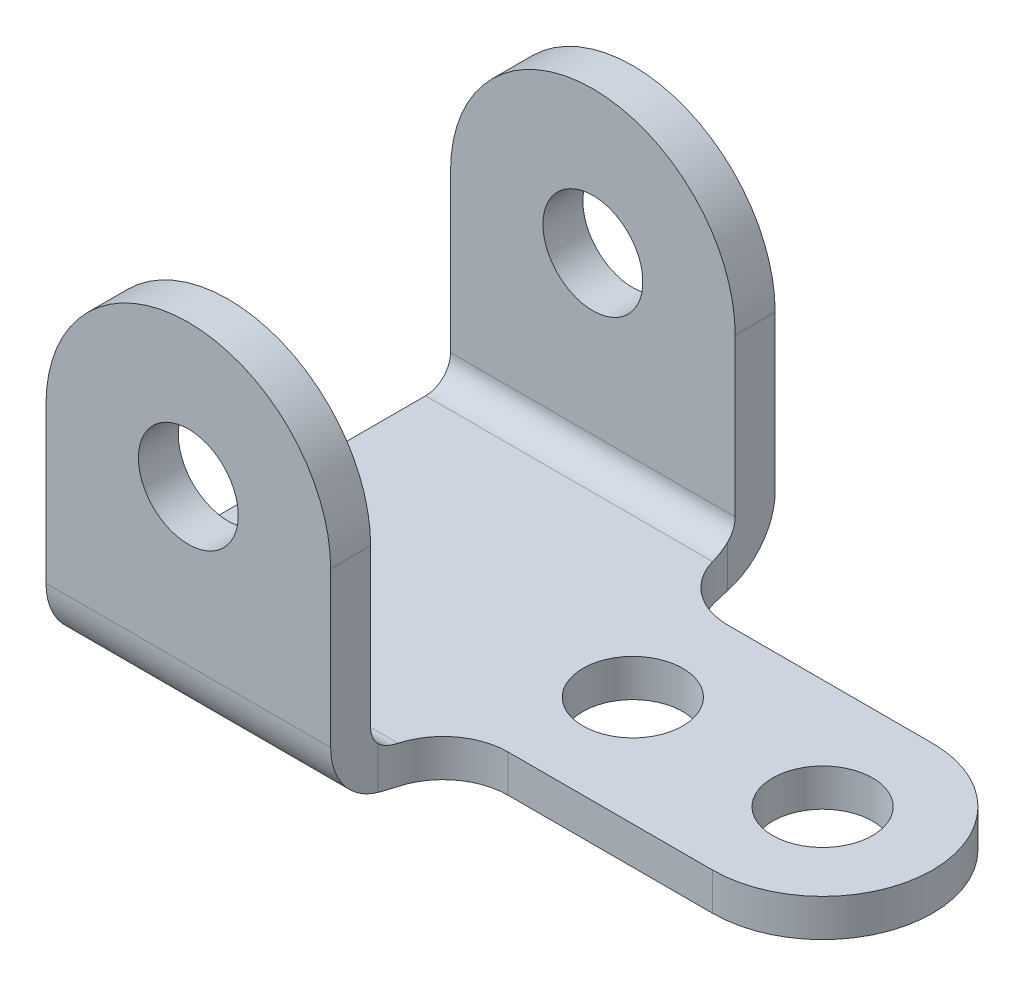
ISO-10303-21;
HEADER;
FILE_DESCRIPTION(('STEP AP214'),'2;1');
FILE_NAME('part.step','',(''),(''),'','','');
FILE_SCHEMA(('AUTOMOTIVE_DESIGN { 1 0 10303 214 1 1 1 1 }'));
ENDSEC;
DATA;
#1=APPLICATION_CONTEXT('core data for automotive mechanical design processes');
#2=APPLICATION_PROTOCOL_DEFINITION('international standard','automotive_design',2000,#1);
#3=PRODUCT_CONTEXT('',#1,'mechanical');
#4=PRODUCT('Part','Part','',(#3));
#5=PRODUCT_RELATED_PRODUCT_CATEGORY('part','',(#4));
#6=PRODUCT_DEFINITION_FORMATION('','',#4);
#7=PRODUCT_DEFINITION_CONTEXT('part definition',#1,'design');
#8=PRODUCT_DEFINITION('design','',#6,#7);
#9=PRODUCT_DEFINITION_SHAPE('','',#8);
#10=(LENGTH_UNIT() NAMED_UNIT(*) SI_UNIT(.MILLI.,.METRE.));
#11=(NAMED_UNIT(*) PLANE_ANGLE_UNIT() SI_UNIT($,.RADIAN.));
#12=(NAMED_UNIT(*) SI_UNIT($,.STERADIAN.) SOLID_ANGLE_UNIT());
#13=UNCERTAINTY_MEASURE_WITH_UNIT(LENGTH_MEASURE(1.E-05),#10,'distance_accuracy_value','');
#14=(GEOMETRIC_REPRESENTATION_CONTEXT(3) GLOBAL_UNCERTAINTY_ASSIGNED_CONTEXT((#13)) GLOBAL_UNIT_ASSIGNED_CONTEXT((#10,
#11,#12)) REPRESENTATION_CONTEXT('',''));
#15=CARTESIAN_POINT('',(0.,0.,0.));
#16=DIRECTION('',(0.,0.,1.));
#17=DIRECTION('',(1.,0.,0.));
#18=AXIS2_PLACEMENT_3D('',#15,#16,#17);
#19=CARTESIAN_POINT('',(111.,3.75,-44.5));
#20=DIRECTION('',(0.,1.,0.));
#21=DIRECTION('',(0.,0.,1.));
#22=AXIS2_PLACEMENT_3D('',#19,#20,#21);
#23=PLANE('',#22);
#24=DIRECTION('',(0.,0.,1.));
#25=VECTOR('',#24,1.);
#26=CARTESIAN_POINT('',(0.,3.75,-89.));
#27=LINE('',#26,#25);
#28=CARTESIAN_POINT('',(0.,3.75,-76.));
#29=VERTEX_POINT('',#28);
#30=CARTESIAN_POINT('',(0.,3.75,-13.));
#31=VERTEX_POINT('',#30);
#32=EDGE_CURVE('E234',#29,#31,#27,.T.);
#33=ORIENTED_EDGE('',*,*,#32,.T.);
#34=DIRECTION('',(-1.,0.,0.));
#35=VECTOR('',#34,1.);
#36=CARTESIAN_POINT('',(57.,3.75,-13.));
#37=LINE('',#36,#35);
#38=CARTESIAN_POINT('',(57.4800159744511,3.75,-13.));
#39=VERTEX_POINT('',#38);
#40=EDGE_CURVE('E248',#31,#39,#37,.F.);
#41=ORIENTED_EDGE('',*,*,#40,.T.);
#42=CARTESIAN_POINT('',(70.,3.75,-9.50000000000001));
#43=DIRECTION('',(0.,1.,0.));
#44=DIRECTION('',(0.,0.,1.));
#45=AXIS2_PLACEMENT_3D('',#42,#43,#44);
#46=CIRCLE('',#45,13.);
#47=CARTESIAN_POINT('',(70.,3.75,-22.5));
#48=VERTEX_POINT('',#47);
#49=EDGE_CURVE('E350',#39,#48,#46,.F.);
#50=ORIENTED_EDGE('',*,*,#49,.T.);
#51=DIRECTION('',(1.,0.,0.));
#52=VECTOR('',#51,1.);
#53=CARTESIAN_POINT('',(57.,3.75,-22.5));
#54=LINE('',#53,#52);
#55=CARTESIAN_POINT('',(111.,3.75,-22.5));
#56=VERTEX_POINT('',#55);
#57=EDGE_CURVE('E226',#48,#56,#54,.T.);
#58=ORIENTED_EDGE('',*,*,#57,.T.);
#59=CARTESIAN_POINT('',(111.,3.75,-44.5));
#60=DIRECTION('',(0.,1.,0.));
#61=DIRECTION('',(0.,0.,1.));
#62=AXIS2_PLACEMENT_3D('',#59,#60,#61);
#63=CIRCLE('',#62,22.);
#64=CARTESIAN_POINT('',(111.,3.75,-66.5));
#65=VERTEX_POINT('',#64);
#66=EDGE_CURVE('E228',#56,#65,#63,.T.);
#67=ORIENTED_EDGE('',*,*,#66,.T.);
#68=DIRECTION('',(-1.,0.,0.));
#69=VECTOR('',#68,1.);
#70=CARTESIAN_POINT('',(111.,3.75,-66.5));
#71=LINE('',#70,#69);
#72=CARTESIAN_POINT('',(70.,3.75,-66.5));
#73=VERTEX_POINT('',#72);
#74=EDGE_CURVE('E231',#65,#73,#71,.T.);
#75=ORIENTED_EDGE('',*,*,#74,.T.);
#76=CARTESIAN_POINT('',(70.,3.75,-79.5));
#77=DIRECTION('',(0.,1.,0.));
#78=DIRECTION('',(0.,0.,1.));
#79=AXIS2_PLACEMENT_3D('',#76,#77,#78);
#80=CIRCLE('',#79,13.);
#81=CARTESIAN_POINT('',(57.4800159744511,3.75,-76.));
#82=VERTEX_POINT('',#81);
#83=EDGE_CURVE('E354',#73,#82,#80,.F.);
#84=ORIENTED_EDGE('',*,*,#83,.T.);
#85=DIRECTION('',(-1.,0.,0.));
#86=VECTOR('',#85,1.);
#87=CARTESIAN_POINT('',(0.,3.75,-76.));
#88=LINE('',#87,#86);
#89=EDGE_CURVE('E245',#82,#29,#88,.T.);
#90=ORIENTED_EDGE('',*,*,#89,.T.);
#91=EDGE_LOOP('',(#33,#41,#50,#58,#67,#75,#84,#90));
#92=FACE_BOUND('',#91,.T.);
#93=CARTESIAN_POINT('',(111.,3.75,-44.5));
#94=DIRECTION('',(0.,1.,0.));
#95=DIRECTION('',(0.,0.,1.));
#96=AXIS2_PLACEMENT_3D('',#93,#94,#95);
#97=CIRCLE('',#96,9.99999999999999);
#98=CARTESIAN_POINT('',(111.,3.75,-34.5));
#99=VERTEX_POINT('',#98);
#100=EDGE_CURVE('E220',#99,#99,#97,.T.);
#101=ORIENTED_EDGE('',*,*,#100,.F.);
#102=EDGE_LOOP('',(#101));
#103=FACE_BOUND('',#102,.T.);
#104=CARTESIAN_POINT('',(73.,3.75,-44.5));
#105=DIRECTION('',(0.,1.,0.));
#106=DIRECTION('',(0.,0.,1.));
#107=AXIS2_PLACEMENT_3D('',#104,#105,#106);
#108=CIRCLE('',#107,10.);
#109=CARTESIAN_POINT('',(73.,3.75,-34.5));
#110=VERTEX_POINT('',#109);
#111=EDGE_CURVE('E214',#110,#110,#108,.T.);
#112=ORIENTED_EDGE('',*,*,#111,.F.);
#113=EDGE_LOOP('',(#112));
#114=FACE_BOUND('',#113,.T.);
#115=ADVANCED_FACE('F38',(#92,#103,#114),#23,.T.);
#116=CARTESIAN_POINT('',(111.,-3.75,-44.5));
#117=DIRECTION('',(0.,1.,0.));
#118=DIRECTION('',(0.,0.,1.));
#119=AXIS2_PLACEMENT_3D('',#116,#117,#118);
#120=PLANE('',#119);
#121=CARTESIAN_POINT('',(70.,-3.75,-9.50000000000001));
#122=DIRECTION('',(0.,1.,0.));
#123=DIRECTION('',(0.,0.,1.));
#124=AXIS2_PLACEMENT_3D('',#121,#122,#123);
#125=CIRCLE('',#124,13.);
#126=CARTESIAN_POINT('',(70.,-3.75,-22.5));
#127=VERTEX_POINT('',#126);
#128=CARTESIAN_POINT('',(57.4800159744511,-3.75,-13.));
#129=VERTEX_POINT('',#128);
#130=EDGE_CURVE('E347',#127,#129,#125,.T.);
#131=ORIENTED_EDGE('',*,*,#130,.T.);
#132=DIRECTION('',(1.,0.,0.));
#133=VECTOR('',#132,1.);
#134=CARTESIAN_POINT('',(111.,-3.75,-13.));
#135=LINE('',#134,#133);
#136=CARTESIAN_POINT('',(0.,-3.75,-13.));
#137=VERTEX_POINT('',#136);
#138=EDGE_CURVE('E301',#129,#137,#135,.F.);
#139=ORIENTED_EDGE('',*,*,#138,.T.);
#140=DIRECTION('',(0.,0.,1.));
#141=VECTOR('',#140,1.);
#142=CARTESIAN_POINT('',(0.,-3.75,-89.));
#143=LINE('',#142,#141);
#144=CARTESIAN_POINT('',(0.,-3.75,-76.));
#145=VERTEX_POINT('',#144);
#146=EDGE_CURVE('E229',#145,#137,#143,.T.);
#147=ORIENTED_EDGE('',*,*,#146,.F.);
#148=DIRECTION('',(-1.,0.,0.));
#149=VECTOR('',#148,1.);
#150=CARTESIAN_POINT('',(111.,-3.75,-76.));
#151=LINE('',#150,#149);
#152=CARTESIAN_POINT('',(57.4800159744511,-3.75,-76.));
#153=VERTEX_POINT('',#152);
#154=EDGE_CURVE('E299',#145,#153,#151,.F.);
#155=ORIENTED_EDGE('',*,*,#154,.T.);
#156=CARTESIAN_POINT('',(70.,-3.75,-79.5));
#157=DIRECTION('',(0.,1.,0.));
#158=DIRECTION('',(0.,0.,1.));
#159=AXIS2_PLACEMENT_3D('',#156,#157,#158);
#160=CIRCLE('',#159,13.);
#161=CARTESIAN_POINT('',(70.,-3.75,-66.5));
#162=VERTEX_POINT('',#161);
#163=EDGE_CURVE('E352',#153,#162,#160,.T.);
#164=ORIENTED_EDGE('',*,*,#163,.T.);
#165=DIRECTION('',(-1.,0.,0.));
#166=VECTOR('',#165,1.);
#167=CARTESIAN_POINT('',(111.,-3.75,-66.5));
#168=LINE('',#167,#166);
#169=CARTESIAN_POINT('',(111.,-3.75,-66.5));
#170=VERTEX_POINT('',#169);
#171=EDGE_CURVE('E398',#170,#162,#168,.T.);
#172=ORIENTED_EDGE('',*,*,#171,.F.);
#173=CARTESIAN_POINT('',(111.,-3.75,-44.5));
#174=DIRECTION('',(0.,1.,0.));
#175=DIRECTION('',(0.,0.,1.));
#176=AXIS2_PLACEMENT_3D('',#173,#174,#175);
#177=CIRCLE('',#176,22.);
#178=CARTESIAN_POINT('',(111.,-3.75,-22.5));
#179=VERTEX_POINT('',#178);
#180=EDGE_CURVE('E406',#179,#170,#177,.T.);
#181=ORIENTED_EDGE('',*,*,#180,.F.);
#182=DIRECTION('',(1.,0.,0.));
#183=VECTOR('',#182,1.);
#184=CARTESIAN_POINT('',(57.,-3.75,-22.5));
#185=LINE('',#184,#183);
#186=EDGE_CURVE('E223',#127,#179,#185,.T.);
#187=ORIENTED_EDGE('',*,*,#186,.F.);
#188=EDGE_LOOP('',(#131,#139,#147,#155,#164,#172,#181,#187));
#189=FACE_BOUND('',#188,.T.);
#190=CARTESIAN_POINT('',(111.,-3.75,-44.5));
#191=DIRECTION('',(0.,1.,0.));
#192=DIRECTION('',(0.,0.,1.));
#193=AXIS2_PLACEMENT_3D('',#190,#191,#192);
#194=CIRCLE('',#193,9.99999999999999);
#195=CARTESIAN_POINT('',(111.,-3.75,-34.5));
#196=VERTEX_POINT('',#195);
#197=EDGE_CURVE('E217',#196,#196,#194,.T.);
#198=ORIENTED_EDGE('',*,*,#197,.T.);
#199=EDGE_LOOP('',(#198));
#200=FACE_BOUND('',#199,.T.);
#201=CARTESIAN_POINT('',(73.,-3.75,-44.5));
#202=DIRECTION('',(0.,1.,0.));
#203=DIRECTION('',(0.,0.,1.));
#204=AXIS2_PLACEMENT_3D('',#201,#202,#203);
#205=CIRCLE('',#204,10.);
#206=CARTESIAN_POINT('',(73.,-3.75,-34.5));
#207=VERTEX_POINT('',#206);
#208=EDGE_CURVE('E213',#207,#207,#205,.T.);
#209=ORIENTED_EDGE('',*,*,#208,.T.);
#210=EDGE_LOOP('',(#209));
#211=FACE_BOUND('',#210,.T.);
#212=ADVANCED_FACE('F390',(#189,#200,#211),#120,.F.);
#213=CARTESIAN_POINT('',(0.,3.75,0.));
#214=DIRECTION('',(0.,0.,-1.));
#215=DIRECTION('',(-1.,0.,0.));
#216=AXIS2_PLACEMENT_3D('',#213,#214,#215);
#217=PLANE('',#216);
#218=DIRECTION('',(0.,-1.,0.));
#219=VECTOR('',#218,1.);
#220=CARTESIAN_POINT('',(0.,3.75,0.));
#221=LINE('',#220,#219);
#222=CARTESIAN_POINT('',(0.,40.25,0.));
#223=VERTEX_POINT('',#222);
#224=CARTESIAN_POINT('',(0.,9.25,0.));
#225=VERTEX_POINT('',#224);
#226=EDGE_CURVE('E242',#223,#225,#221,.T.);
#227=ORIENTED_EDGE('',*,*,#226,.T.);
#228=DIRECTION('',(1.,0.,0.));
#229=VECTOR('',#228,1.);
#230=CARTESIAN_POINT('',(0.,9.25,0.));
#231=LINE('',#230,#229);
#232=CARTESIAN_POINT('',(57.,9.25,0.));
#233=VERTEX_POINT('',#232);
#234=EDGE_CURVE('E288',#225,#233,#231,.T.);
#235=ORIENTED_EDGE('',*,*,#234,.T.);
#236=DIRECTION('',(0.,-1.,0.));
#237=VECTOR('',#236,1.);
#238=CARTESIAN_POINT('',(57.,3.75,0.));
#239=LINE('',#238,#237);
#240=CARTESIAN_POINT('',(57.,40.25,0.));
#241=VERTEX_POINT('',#240);
#242=EDGE_CURVE('E335',#241,#233,#239,.T.);
#243=ORIENTED_EDGE('',*,*,#242,.F.);
#244=CARTESIAN_POINT('',(28.5,40.25,0.));
#245=DIRECTION('',(0.,0.,-1.));
#246=DIRECTION('',(-1.,0.,0.));
#247=AXIS2_PLACEMENT_3D('',#244,#245,#246);
#248=CIRCLE('',#247,28.5);
#249=EDGE_CURVE('E198',#223,#241,#248,.T.);
#250=ORIENTED_EDGE('',*,*,#249,.F.);
#251=EDGE_LOOP('',(#227,#235,#243,#250));
#252=FACE_BOUND('',#251,.T.);
#253=CARTESIAN_POINT('',(28.5,40.25,0.));
#254=DIRECTION('',(0.,0.,-1.));
#255=DIRECTION('',(-1.,0.,0.));
#256=AXIS2_PLACEMENT_3D('',#253,#254,#255);
#257=CIRCLE('',#256,10.);
#258=CARTESIAN_POINT('',(18.5,40.25,0.));
#259=VERTEX_POINT('',#258);
#260=EDGE_CURVE('E172',#259,#259,#257,.T.);
#261=ORIENTED_EDGE('',*,*,#260,.T.);
#262=EDGE_LOOP('',(#261));
#263=FACE_BOUND('',#262,.T.);
#264=ADVANCED_FACE('F419',(#252,#263),#217,.F.);
#265=CARTESIAN_POINT('',(57.,3.75,0.));
#266=DIRECTION('',(-1.,0.,0.));
#267=DIRECTION('',(0.,0.,1.));
#268=AXIS2_PLACEMENT_3D('',#265,#266,#267);
#269=PLANE('',#268);
#270=ORIENTED_EDGE('',*,*,#242,.T.);
#271=CARTESIAN_POINT('',(57.,9.25,-13.));
#272=DIRECTION('',(-1.,0.,0.));
#273=DIRECTION('',(0.,0.,1.));
#274=AXIS2_PLACEMENT_3D('',#271,#272,#273);
#275=CIRCLE('',#274,13.);
#276=CARTESIAN_POINT('',(57.,-3.26998402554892,-9.50000000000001));
#277=VERTEX_POINT('',#276);
#278=EDGE_CURVE('E292',#233,#277,#275,.F.);
#279=ORIENTED_EDGE('',*,*,#278,.T.);
#280=DIRECTION('',(0.,-1.,0.));
#281=VECTOR('',#280,1.);
#282=CARTESIAN_POINT('',(57.,3.75,-9.50000000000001));
#283=LINE('',#282,#281);
#284=CARTESIAN_POINT('',(57.,5.17928578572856,-9.50000000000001));
#285=VERTEX_POINT('',#284);
#286=EDGE_CURVE('E341',#277,#285,#283,.F.);
#287=ORIENTED_EDGE('',*,*,#286,.T.);
#288=CARTESIAN_POINT('',(57.,8.75,-13.));
#289=DIRECTION('',(-1.,0.,0.));
#290=DIRECTION('',(0.,0.,1.));
#291=AXIS2_PLACEMENT_3D('',#288,#289,#290);
#292=CIRCLE('',#291,5.);
#293=CARTESIAN_POINT('',(57.,8.75,-8.));
#294=VERTEX_POINT('',#293);
#295=EDGE_CURVE('E261',#285,#294,#292,.T.);
#296=ORIENTED_EDGE('',*,*,#295,.T.);
#297=DIRECTION('',(0.,-1.,0.));
#298=VECTOR('',#297,1.);
#299=CARTESIAN_POINT('',(57.,40.25,-8.));
#300=LINE('',#299,#298);
#301=CARTESIAN_POINT('',(57.,40.25,-8.));
#302=VERTEX_POINT('',#301);
#303=EDGE_CURVE('E203',#302,#294,#300,.T.);
#304=ORIENTED_EDGE('',*,*,#303,.F.);
#305=DIRECTION('',(0.,0.,1.));
#306=VECTOR('',#305,1.);
#307=CARTESIAN_POINT('',(57.,40.25,-8.));
#308=LINE('',#307,#306);
#309=EDGE_CURVE('E207',#302,#241,#308,.T.);
#310=ORIENTED_EDGE('',*,*,#309,.T.);
#311=EDGE_LOOP('',(#270,#279,#287,#296,#304,#310));
#312=FACE_BOUND('',#311,.T.);
#313=ADVANCED_FACE('F376',(#312),#269,.F.);
#314=CARTESIAN_POINT('',(57.,3.75,-22.5));
#315=DIRECTION('',(0.,0.,-1.));
#316=DIRECTION('',(-1.,0.,0.));
#317=AXIS2_PLACEMENT_3D('',#314,#315,#316);
#318=PLANE('',#317);
#319=ORIENTED_EDGE('',*,*,#57,.F.);
#320=DIRECTION('',(0.,-1.,0.));
#321=VECTOR('',#320,1.);
#322=CARTESIAN_POINT('',(70.,-3.75,-22.5));
#323=LINE('',#322,#321);
#324=EDGE_CURVE('E338',#48,#127,#323,.T.);
#325=ORIENTED_EDGE('',*,*,#324,.T.);
#326=ORIENTED_EDGE('',*,*,#186,.T.);
#327=DIRECTION('',(0.,-1.,0.));
#328=VECTOR('',#327,1.);
#329=CARTESIAN_POINT('',(111.,3.75,-22.5));
#330=LINE('',#329,#328);
#331=EDGE_CURVE('E332',#56,#179,#330,.T.);
#332=ORIENTED_EDGE('',*,*,#331,.F.);
#333=EDGE_LOOP('',(#319,#325,#326,#332));
#334=FACE_BOUND('',#333,.T.);
#335=ADVANCED_FACE('F410',(#334),#318,.F.);
#336=CARTESIAN_POINT('',(111.,3.75,-44.5));
#337=DIRECTION('',(0.,-1.,0.));
#338=DIRECTION('',(0.,0.,-1.));
#339=AXIS2_PLACEMENT_3D('',#336,#337,#338);
#340=CYLINDRICAL_SURFACE('',#339,22.);
#341=ORIENTED_EDGE('',*,*,#180,.T.);
#342=DIRECTION('',(0.,-1.,0.));
#343=VECTOR('',#342,1.);
#344=CARTESIAN_POINT('',(111.,3.75,-66.5));
#345=LINE('',#344,#343);
#346=EDGE_CURVE('E324',#65,#170,#345,.T.);
#347=ORIENTED_EDGE('',*,*,#346,.F.);
#348=ORIENTED_EDGE('',*,*,#66,.F.);
#349=ORIENTED_EDGE('',*,*,#331,.T.);
#350=EDGE_LOOP('',(#341,#347,#348,#349));
#351=FACE_BOUND('',#350,.T.);
#352=ADVANCED_FACE('F404',(#351),#340,.T.);
#353=CARTESIAN_POINT('',(111.,3.75,-66.5));
#354=DIRECTION('',(0.,0.,1.));
#355=DIRECTION('',(1.,0.,0.));
#356=AXIS2_PLACEMENT_3D('',#353,#354,#355);
#357=PLANE('',#356);
#358=ORIENTED_EDGE('',*,*,#171,.T.);
#359=DIRECTION('',(0.,-1.,0.));
#360=VECTOR('',#359,1.);
#361=CARTESIAN_POINT('',(70.,3.75,-66.5));
#362=LINE('',#361,#360);
#363=EDGE_CURVE('E345',#162,#73,#362,.F.);
#364=ORIENTED_EDGE('',*,*,#363,.T.);
#365=ORIENTED_EDGE('',*,*,#74,.F.);
#366=ORIENTED_EDGE('',*,*,#346,.T.);
#367=EDGE_LOOP('',(#358,#364,#365,#366));
#368=FACE_BOUND('',#367,.T.);
#369=ADVANCED_FACE('F397',(#368),#357,.F.);
#370=CARTESIAN_POINT('',(57.,3.75,-89.));
#371=DIRECTION('',(-1.,0.,0.));
#372=DIRECTION('',(0.,0.,1.));
#373=AXIS2_PLACEMENT_3D('',#370,#371,#372);
#374=PLANE('',#373);
#375=DIRECTION('',(0.,-1.,0.));
#376=VECTOR('',#375,1.);
#377=CARTESIAN_POINT('',(57.,-3.75,-79.5));
#378=LINE('',#377,#376);
#379=CARTESIAN_POINT('',(57.,5.17928578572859,-79.5));
#380=VERTEX_POINT('',#379);
#381=CARTESIAN_POINT('',(57.,-3.26998402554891,-79.5));
#382=VERTEX_POINT('',#381);
#383=EDGE_CURVE('E343',#380,#382,#378,.T.);
#384=ORIENTED_EDGE('',*,*,#383,.T.);
#385=CARTESIAN_POINT('',(57.,9.25,-76.));
#386=DIRECTION('',(-1.,0.,0.));
#387=DIRECTION('',(0.,0.,1.));
#388=AXIS2_PLACEMENT_3D('',#385,#386,#387);
#389=CIRCLE('',#388,13.);
#390=CARTESIAN_POINT('',(57.,9.25,-89.));
#391=VERTEX_POINT('',#390);
#392=EDGE_CURVE('E11',#382,#391,#389,.F.);
#393=ORIENTED_EDGE('',*,*,#392,.T.);
#394=DIRECTION('',(0.,-1.,0.));
#395=VECTOR('',#394,1.);
#396=CARTESIAN_POINT('',(57.,3.75,-89.));
#397=LINE('',#396,#395);
#398=CARTESIAN_POINT('',(57.,40.25,-89.));
#399=VERTEX_POINT('',#398);
#400=EDGE_CURVE('E167',#399,#391,#397,.T.);
#401=ORIENTED_EDGE('',*,*,#400,.F.);
#402=DIRECTION('',(0.,0.,-1.));
#403=VECTOR('',#402,1.);
#404=CARTESIAN_POINT('',(57.,40.25,-81.));
#405=LINE('',#404,#403);
#406=CARTESIAN_POINT('',(57.,40.25,-81.));
#407=VERTEX_POINT('',#406);
#408=EDGE_CURVE('E161',#407,#399,#405,.T.);
#409=ORIENTED_EDGE('',*,*,#408,.F.);
#410=DIRECTION('',(0.,-1.,0.));
#411=VECTOR('',#410,1.);
#412=CARTESIAN_POINT('',(57.,40.25,-81.));
#413=LINE('',#412,#411);
#414=CARTESIAN_POINT('',(57.,8.75,-81.));
#415=VERTEX_POINT('',#414);
#416=EDGE_CURVE('E165',#407,#415,#413,.T.);
#417=ORIENTED_EDGE('',*,*,#416,.T.);
#418=CARTESIAN_POINT('',(57.,8.75,-76.));
#419=DIRECTION('',(-1.,0.,0.));
#420=DIRECTION('',(0.,0.,1.));
#421=AXIS2_PLACEMENT_3D('',#418,#419,#420);
#422=CIRCLE('',#421,5.);
#423=EDGE_CURVE('E289',#415,#380,#422,.T.);
#424=ORIENTED_EDGE('',*,*,#423,.T.);
#425=EDGE_LOOP('',(#384,#393,#401,#409,#417,#424));
#426=FACE_BOUND('',#425,.T.);
#427=ADVANCED_FACE('F163',(#426),#374,.F.);
#428=CARTESIAN_POINT('',(0.,3.75,-89.));
#429=DIRECTION('',(0.,0.,1.));
#430=DIRECTION('',(1.,0.,0.));
#431=AXIS2_PLACEMENT_3D('',#428,#429,#430);
#432=PLANE('',#431);
#433=ORIENTED_EDGE('',*,*,#400,.T.);
#434=DIRECTION('',(-1.,0.,0.));
#435=VECTOR('',#434,1.);
#436=CARTESIAN_POINT('',(0.,9.25,-89.));
#437=LINE('',#436,#435);
#438=CARTESIAN_POINT('',(0.,9.25,-89.));
#439=VERTEX_POINT('',#438);
#440=EDGE_CURVE('E307',#391,#439,#437,.T.);
#441=ORIENTED_EDGE('',*,*,#440,.T.);
#442=DIRECTION('',(0.,-1.,0.));
#443=VECTOR('',#442,1.);
#444=CARTESIAN_POINT('',(0.,3.75,-89.));
#445=LINE('',#444,#443);
#446=CARTESIAN_POINT('',(0.,40.25,-89.));
#447=VERTEX_POINT('',#446);
#448=EDGE_CURVE('E317',#447,#439,#445,.T.);
#449=ORIENTED_EDGE('',*,*,#448,.F.);
#450=CARTESIAN_POINT('',(28.5,40.25,-89.));
#451=DIRECTION('',(0.,0.,-1.));
#452=DIRECTION('',(-1.,0.,0.));
#453=AXIS2_PLACEMENT_3D('',#450,#451,#452);
#454=CIRCLE('',#453,28.5);
#455=EDGE_CURVE('E182',#447,#399,#454,.T.);
#456=ORIENTED_EDGE('',*,*,#455,.T.);
#457=EDGE_LOOP('',(#433,#441,#449,#456));
#458=FACE_BOUND('',#457,.T.);
#459=CARTESIAN_POINT('',(28.5,40.25,-89.));
#460=DIRECTION('',(0.,0.,-1.));
#461=DIRECTION('',(-1.,0.,0.));
#462=AXIS2_PLACEMENT_3D('',#459,#460,#461);
#463=CIRCLE('',#462,10.);
#464=CARTESIAN_POINT('',(18.5,40.25,-89.));
#465=VERTEX_POINT('',#464);
#466=EDGE_CURVE('E619',#465,#465,#463,.T.);
#467=ORIENTED_EDGE('',*,*,#466,.F.);
#468=EDGE_LOOP('',(#467));
#469=FACE_BOUND('',#468,.T.);
#470=ADVANCED_FACE('F315',(#458,#469),#432,.F.);
#471=CARTESIAN_POINT('',(0.,3.75,-89.));
#472=DIRECTION('',(1.,0.,0.));
#473=DIRECTION('',(0.,0.,-1.));
#474=AXIS2_PLACEMENT_3D('',#471,#472,#473);
#475=PLANE('',#474);
#476=ORIENTED_EDGE('',*,*,#146,.T.);
#477=CARTESIAN_POINT('',(0.,9.25,-13.));
#478=DIRECTION('',(1.,0.,0.));
#479=DIRECTION('',(0.,0.,-1.));
#480=AXIS2_PLACEMENT_3D('',#477,#478,#479);
#481=CIRCLE('',#480,13.);
#482=EDGE_CURVE('E305',#137,#225,#481,.F.);
#483=ORIENTED_EDGE('',*,*,#482,.T.);
#484=ORIENTED_EDGE('',*,*,#226,.F.);
#485=DIRECTION('',(0.,0.,1.));
#486=VECTOR('',#485,1.);
#487=CARTESIAN_POINT('',(0.,40.25,-8.));
#488=LINE('',#487,#486);
#489=CARTESIAN_POINT('',(0.,40.25,-8.));
#490=VERTEX_POINT('',#489);
#491=EDGE_CURVE('E210',#490,#223,#488,.T.);
#492=ORIENTED_EDGE('',*,*,#491,.F.);
#493=DIRECTION('',(0.,1.,0.));
#494=VECTOR('',#493,1.);
#495=CARTESIAN_POINT('',(0.,3.75,-8.));
#496=LINE('',#495,#494);
#497=CARTESIAN_POINT('',(0.,8.75,-8.));
#498=VERTEX_POINT('',#497);
#499=EDGE_CURVE('E204',#498,#490,#496,.T.);
#500=ORIENTED_EDGE('',*,*,#499,.F.);
#501=CARTESIAN_POINT('',(0.,8.75,-13.));
#502=DIRECTION('',(1.,0.,0.));
#503=DIRECTION('',(0.,0.,-1.));
#504=AXIS2_PLACEMENT_3D('',#501,#502,#503);
#505=CIRCLE('',#504,5.);
#506=EDGE_CURVE('E251',#498,#31,#505,.T.);
#507=ORIENTED_EDGE('',*,*,#506,.T.);
#508=ORIENTED_EDGE('',*,*,#32,.F.);
#509=CARTESIAN_POINT('',(0.,8.75,-76.));
#510=DIRECTION('',(1.,0.,0.));
#511=DIRECTION('',(0.,0.,-1.));
#512=AXIS2_PLACEMENT_3D('',#509,#510,#511);
#513=CIRCLE('',#512,5.);
#514=CARTESIAN_POINT('',(0.,8.75,-81.));
#515=VERTEX_POINT('',#514);
#516=EDGE_CURVE('E387',#29,#515,#513,.T.);
#517=ORIENTED_EDGE('',*,*,#516,.T.);
#518=DIRECTION('',(0.,1.,0.));
#519=VECTOR('',#518,1.);
#520=CARTESIAN_POINT('',(0.,3.75,-81.));
#521=LINE('',#520,#519);
#522=CARTESIAN_POINT('',(0.,40.25,-81.));
#523=VERTEX_POINT('',#522);
#524=EDGE_CURVE('E187',#515,#523,#521,.T.);
#525=ORIENTED_EDGE('',*,*,#524,.T.);
#526=DIRECTION('',(0.,0.,-1.));
#527=VECTOR('',#526,1.);
#528=CARTESIAN_POINT('',(0.,40.25,-81.));
#529=LINE('',#528,#527);
#530=EDGE_CURVE('E173',#523,#447,#529,.T.);
#531=ORIENTED_EDGE('',*,*,#530,.T.);
#532=ORIENTED_EDGE('',*,*,#448,.T.);
#533=CARTESIAN_POINT('',(0.,9.25,-76.));
#534=DIRECTION('',(1.,0.,0.));
#535=DIRECTION('',(0.,0.,-1.));
#536=AXIS2_PLACEMENT_3D('',#533,#534,#535);
#537=CIRCLE('',#536,13.);
#538=EDGE_CURVE('E303',#439,#145,#537,.F.);
#539=ORIENTED_EDGE('',*,*,#538,.T.);
#540=EDGE_LOOP('',(#476,#483,#484,#492,#500,#507,#508,#517,#525,#531,#532,#539));
#541=FACE_BOUND('',#540,.T.);
#542=ADVANCED_FACE('F321',(#541),#475,.F.);
#543=CARTESIAN_POINT('',(111.,3.75,-44.5));
#544=DIRECTION('',(0.,-1.,0.));
#545=DIRECTION('',(0.,0.,-1.));
#546=AXIS2_PLACEMENT_3D('',#543,#544,#545);
#547=CYLINDRICAL_SURFACE('',#546,9.99999999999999);
#548=ORIENTED_EDGE('',*,*,#100,.T.);
#549=EDGE_LOOP('',(#548));
#550=FACE_BOUND('',#549,.T.);
#551=ORIENTED_EDGE('',*,*,#197,.F.);
#552=EDGE_LOOP('',(#551));
#553=FACE_BOUND('',#552,.T.);
#554=ADVANCED_FACE('F428',(#550,#553),#547,.F.);
#555=CARTESIAN_POINT('',(73.,3.75,-44.5));
#556=DIRECTION('',(0.,-1.,0.));
#557=DIRECTION('',(0.,0.,-1.));
#558=AXIS2_PLACEMENT_3D('',#555,#556,#557);
#559=CYLINDRICAL_SURFACE('',#558,10.);
#560=ORIENTED_EDGE('',*,*,#111,.T.);
#561=EDGE_LOOP('',(#560));
#562=FACE_BOUND('',#561,.T.);
#563=ORIENTED_EDGE('',*,*,#208,.F.);
#564=EDGE_LOOP('',(#563));
#565=FACE_BOUND('',#564,.T.);
#566=ADVANCED_FACE('F423',(#562,#565),#559,.F.);
#567=CARTESIAN_POINT('',(70.,3.75,-9.50000000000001));
#568=DIRECTION('',(0.,1.,0.));
#569=DIRECTION('',(0.,0.,1.));
#570=AXIS2_PLACEMENT_3D('',#567,#568,#569);
#571=CYLINDRICAL_SURFACE('',#570,13.);
#572=ORIENTED_EDGE('',*,*,#286,.F.);
#573=CARTESIAN_POINT('',(57.,-3.26998402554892,-9.50000000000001));
#574=CARTESIAN_POINT('',(56.9999976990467,-3.31041644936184,-9.64462311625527));
#575=CARTESIAN_POINT('',(57.0024140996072,-3.34833258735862,-9.7899308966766));
#576=CARTESIAN_POINT('',(57.0121976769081,-3.41907916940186,-10.0816188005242));
#577=CARTESIAN_POINT('',(57.0195650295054,-3.451909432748,-10.2279989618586));
#578=CARTESIAN_POINT('',(57.0490758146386,-3.54211448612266,-10.6655069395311));
#579=CARTESIAN_POINT('',(57.078624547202,-3.59197060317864,-10.9577534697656));
#580=CARTESIAN_POINT('',(57.1580293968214,-3.67137545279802,-11.5422465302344));
#581=CARTESIAN_POINT('',(57.2078855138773,-3.70092418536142,-11.8344930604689));
#582=CARTESIAN_POINT('',(57.298090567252,-3.73043497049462,-12.2720010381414));
#583=CARTESIAN_POINT('',(57.3309208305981,-3.73780232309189,-12.4183811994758));
#584=CARTESIAN_POINT('',(57.4016674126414,-3.74758590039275,-12.7100691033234));
#585=CARTESIAN_POINT('',(57.4395835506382,-3.75000230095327,-12.8553768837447));
#586=CARTESIAN_POINT('',(57.4800159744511,-3.75,-13.));
#587=B_SPLINE_CURVE_WITH_KNOTS('',3,(#573,#574,#575,#576,#577,#578,#579,#580,#581,#582,#583,
#584,#585,#586),.UNSPECIFIED.,.F.,.F.,(4,2,2,2,2,2,4),(0.,0.450425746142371,0.900867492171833,
1.79321844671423,2.68556940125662,3.13601114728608,3.58643689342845),.UNSPECIFIED.);
#588=EDGE_CURVE('E294',#277,#129,#587,.T.);
#589=ORIENTED_EDGE('',*,*,#588,.T.);
#590=ORIENTED_EDGE('',*,*,#130,.F.);
#591=ORIENTED_EDGE('',*,*,#324,.F.);
#592=ORIENTED_EDGE('',*,*,#49,.F.);
#593=CARTESIAN_POINT('',(57.4800159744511,3.75,-13.));
#594=CARTESIAN_POINT('',(57.4437070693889,3.74998201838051,-12.8701883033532));
#595=CARTESIAN_POINT('',(57.409448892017,3.75505500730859,-12.7397873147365));
#596=CARTESIAN_POINT('',(57.3451549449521,3.77552742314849,-12.4787312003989));
#597=CARTESIAN_POINT('',(57.3151199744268,3.79092880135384,-12.3480760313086));
#598=CARTESIAN_POINT('',(57.2594170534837,3.83219531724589,-12.0875318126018));
#599=CARTESIAN_POINT('',(57.2337475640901,3.85805675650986,-11.9576425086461));
#600=CARTESIAN_POINT('',(57.186767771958,3.92023990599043,-11.6996060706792));
#601=CARTESIAN_POINT('',(57.1654569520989,3.95656037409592,-11.5714587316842));
#602=CARTESIAN_POINT('',(57.1270609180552,4.03962395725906,-11.3176751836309));
#603=CARTESIAN_POINT('',(57.1099834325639,4.08638584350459,-11.1920439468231));
#604=CARTESIAN_POINT('',(57.0799049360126,4.19005789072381,-10.9445366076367));
#605=CARTESIAN_POINT('',(57.066903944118,4.24696809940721,-10.8226605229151));
#606=CARTESIAN_POINT('',(57.0447009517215,4.37050448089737,-10.5837889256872));
#607=CARTESIAN_POINT('',(57.0354938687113,4.43711749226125,-10.4667870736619));
#608=CARTESIAN_POINT('',(57.0204848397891,4.57964874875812,-10.2384282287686));
#609=CARTESIAN_POINT('',(57.0146815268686,4.65556324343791,-10.1270689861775));
#610=CARTESIAN_POINT('',(57.0067083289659,4.80378008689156,-9.92748961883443));
#611=CARTESIAN_POINT('',(57.0041157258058,4.87482970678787,-9.83835193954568));
#612=CARTESIAN_POINT('',(57.0007617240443,5.02275844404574,-9.66523874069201));
#613=CARTESIAN_POINT('',(56.9999976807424,5.09962897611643,-9.5812559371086));
#614=CARTESIAN_POINT('',(57.,5.17928578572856,-9.50000000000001));
#615=B_SPLINE_CURVE_WITH_KNOTS('',3,(#593,#594,#595,#596,#597,#598,#599,#600,#601,#602,#603,
#604,#605,#606,#607,#608,#609,#610,#611,#612,#613,#614),.UNSPECIFIED.,.F.,.F.,(4,2,2,2,2,2,2,2,
2,2,4),(0.,0.404292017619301,0.808660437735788,1.21288600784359,1.61706359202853,
2.02197372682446,2.42688576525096,2.83125358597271,3.23545889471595,3.57724081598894,
3.91852810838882),.UNSPECIFIED.);
#616=EDGE_CURVE('E253',#39,#285,#615,.T.);
#617=ORIENTED_EDGE('',*,*,#616,.T.);
#618=EDGE_LOOP('',(#572,#589,#590,#591,#592,#617));
#619=FACE_BOUND('',#618,.T.);
#620=ADVANCED_FACE('F263',(#619),#571,.F.);
#621=CARTESIAN_POINT('',(70.,3.75,-79.5));
#622=DIRECTION('',(0.,1.,0.));
#623=DIRECTION('',(0.,0.,1.));
#624=AXIS2_PLACEMENT_3D('',#621,#622,#623);
#625=CYLINDRICAL_SURFACE('',#624,13.);
#626=ORIENTED_EDGE('',*,*,#163,.F.);
#627=CARTESIAN_POINT('',(57.4800159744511,-3.75,-76.));
#628=CARTESIAN_POINT('',(57.4395835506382,-3.75000230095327,-76.1446231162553));
#629=CARTESIAN_POINT('',(57.4016674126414,-3.74758590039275,-76.2899308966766));
#630=CARTESIAN_POINT('',(57.3309208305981,-3.73780232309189,-76.5816188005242));
#631=CARTESIAN_POINT('',(57.298090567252,-3.73043497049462,-76.7279989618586));
#632=CARTESIAN_POINT('',(57.2078855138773,-3.70092418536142,-77.1655069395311));
#633=CARTESIAN_POINT('',(57.1580293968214,-3.67137545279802,-77.4577534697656));
#634=CARTESIAN_POINT('',(57.078624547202,-3.59197060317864,-78.0422465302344));
#635=CARTESIAN_POINT('',(57.0490758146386,-3.54211448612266,-78.3344930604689));
#636=CARTESIAN_POINT('',(57.0195650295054,-3.45190943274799,-78.7720010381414));
#637=CARTESIAN_POINT('',(57.0121976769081,-3.41907916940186,-78.9183811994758));
#638=CARTESIAN_POINT('',(57.0024140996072,-3.34833258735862,-79.2100691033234));
#639=CARTESIAN_POINT('',(56.9999976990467,-3.31041644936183,-79.3553768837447));
#640=CARTESIAN_POINT('',(57.,-3.26998402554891,-79.5));
#641=B_SPLINE_CURVE_WITH_KNOTS('',3,(#627,#628,#629,#630,#631,#632,#633,#634,#635,#636,#637,
#638,#639,#640),.UNSPECIFIED.,.F.,.F.,(4,2,2,2,2,2,4),(0.,0.450425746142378,0.90086749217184,
1.79321844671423,2.68556940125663,3.13601114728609,3.58643689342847),.UNSPECIFIED.);
#642=EDGE_CURVE('E47',#153,#382,#641,.T.);
#643=ORIENTED_EDGE('',*,*,#642,.T.);
#644=ORIENTED_EDGE('',*,*,#383,.F.);
#645=CARTESIAN_POINT('',(57.,5.17928578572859,-79.5));
#646=CARTESIAN_POINT('',(56.9999942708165,5.08490857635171,-79.4037396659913));
#647=CARTESIAN_POINT('',(57.0010687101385,4.99444297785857,-79.3036350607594));
#648=CARTESIAN_POINT('',(57.0058527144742,4.82190082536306,-79.0964764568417));
#649=CARTESIAN_POINT('',(57.0095626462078,4.73982544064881,-78.9894214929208));
#650=CARTESIAN_POINT('',(57.0200918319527,4.58466877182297,-78.7691464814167));
#651=CARTESIAN_POINT('',(57.0269105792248,4.51158602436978,-78.6559274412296));
#652=CARTESIAN_POINT('',(57.0440713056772,4.37490171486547,-78.4241716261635));
#653=CARTESIAN_POINT('',(57.054412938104,4.31129922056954,-78.305635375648));
#654=CARTESIAN_POINT('',(57.0789892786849,4.19388077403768,-78.063942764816));
#655=CARTESIAN_POINT('',(57.093230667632,4.14008188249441,-77.9407787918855));
#656=CARTESIAN_POINT('',(57.1258635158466,4.04272097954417,-77.6910027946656));
#657=CARTESIAN_POINT('',(57.1442549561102,3.99915892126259,-77.5643907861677));
#658=CARTESIAN_POINT('',(57.1853269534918,3.92252521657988,-77.3089113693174));
#659=CARTESIAN_POINT('',(57.2080015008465,3.88943904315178,-77.1800473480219));
#660=CARTESIAN_POINT('',(57.2577116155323,3.83376210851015,-76.9209534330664));
#661=CARTESIAN_POINT('',(57.284745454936,3.81116720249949,-76.7907240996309));
#662=CARTESIAN_POINT('',(57.33861185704,3.77910796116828,-76.550085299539));
#663=CARTESIAN_POINT('',(57.3648261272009,3.76815122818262,-76.43973251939));
#664=CARTESIAN_POINT('',(57.4202171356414,3.75359855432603,-76.2194507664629));
#665=CARTESIAN_POINT('',(57.4493896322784,3.74999222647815,-76.109521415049));
#666=CARTESIAN_POINT('',(57.4800159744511,3.74999999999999,-76.));
#667=B_SPLINE_CURVE_WITH_KNOTS('',3,(#645,#646,#647,#648,#649,#650,#651,#652,#653,#654,#655,
#656,#657,#658,#659,#660,#661,#662,#663,#664,#665,#666),.UNSPECIFIED.,.F.,.F.,(4,2,2,2,2,2,2,2,
2,2,4),(0.,0.404318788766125,0.808693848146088,1.21300301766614,1.61727240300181,
2.02223873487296,2.42720321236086,2.83160363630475,3.23584415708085,3.5774272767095,
3.91852736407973),.UNSPECIFIED.);
#668=EDGE_CURVE('E282',#380,#82,#667,.T.);
#669=ORIENTED_EDGE('',*,*,#668,.T.);
#670=ORIENTED_EDGE('',*,*,#83,.F.);
#671=ORIENTED_EDGE('',*,*,#363,.F.);
#672=EDGE_LOOP('',(#626,#643,#644,#669,#670,#671));
#673=FACE_BOUND('',#672,.T.);
#674=ADVANCED_FACE('F274',(#673),#625,.F.);
#675=CARTESIAN_POINT('',(28.5,40.25,-8.));
#676=DIRECTION('',(0.,0.,-1.));
#677=DIRECTION('',(-1.,0.,0.));
#678=AXIS2_PLACEMENT_3D('',#675,#676,#677);
#679=PLANE('',#678);
#680=ORIENTED_EDGE('',*,*,#303,.T.);
#681=DIRECTION('',(-1.,0.,0.));
#682=VECTOR('',#681,1.);
#683=CARTESIAN_POINT('',(0.,8.75,-8.));
#684=LINE('',#683,#682);
#685=EDGE_CURVE('E243',#294,#498,#684,.T.);
#686=ORIENTED_EDGE('',*,*,#685,.T.);
#687=ORIENTED_EDGE('',*,*,#499,.T.);
#688=CARTESIAN_POINT('',(28.5,40.25,-8.));
#689=DIRECTION('',(0.,0.,-1.));
#690=DIRECTION('',(-1.,0.,0.));
#691=AXIS2_PLACEMENT_3D('',#688,#689,#690);
#692=CIRCLE('',#691,28.5);
#693=EDGE_CURVE('E201',#490,#302,#692,.T.);
#694=ORIENTED_EDGE('',*,*,#693,.T.);
#695=EDGE_LOOP('',(#680,#686,#687,#694));
#696=FACE_BOUND('',#695,.T.);
#697=CARTESIAN_POINT('',(28.5,40.25,-8.));
#698=DIRECTION('',(0.,0.,-1.));
#699=DIRECTION('',(-1.,0.,0.));
#700=AXIS2_PLACEMENT_3D('',#697,#698,#699);
#701=CIRCLE('',#700,10.);
#702=CARTESIAN_POINT('',(18.5,40.25,-8.));
#703=VERTEX_POINT('',#702);
#704=EDGE_CURVE('E195',#703,#703,#701,.T.);
#705=ORIENTED_EDGE('',*,*,#704,.F.);
#706=EDGE_LOOP('',(#705));
#707=FACE_BOUND('',#706,.T.);
#708=ADVANCED_FACE('F366',(#696,#707),#679,.T.);
#709=CARTESIAN_POINT('',(28.5,40.25,-8.));
#710=DIRECTION('',(0.,0.,1.));
#711=DIRECTION('',(1.,0.,0.));
#712=AXIS2_PLACEMENT_3D('',#709,#710,#711);
#713=CYLINDRICAL_SURFACE('',#712,28.5);
#714=ORIENTED_EDGE('',*,*,#249,.T.);
#715=ORIENTED_EDGE('',*,*,#309,.F.);
#716=ORIENTED_EDGE('',*,*,#693,.F.);
#717=ORIENTED_EDGE('',*,*,#491,.T.);
#718=EDGE_LOOP('',(#714,#715,#716,#717));
#719=FACE_BOUND('',#718,.T.);
#720=ADVANCED_FACE('F373',(#719),#713,.T.);
#721=CARTESIAN_POINT('',(28.5,40.25,-8.));
#722=DIRECTION('',(0.,0.,1.));
#723=DIRECTION('',(1.,0.,0.));
#724=AXIS2_PLACEMENT_3D('',#721,#722,#723);
#725=CYLINDRICAL_SURFACE('',#724,10.);
#726=ORIENTED_EDGE('',*,*,#704,.T.);
#727=EDGE_LOOP('',(#726));
#728=FACE_BOUND('',#727,.T.);
#729=ORIENTED_EDGE('',*,*,#260,.F.);
#730=EDGE_LOOP('',(#729));
#731=FACE_BOUND('',#730,.T.);
#732=ADVANCED_FACE('F546',(#728,#731),#725,.F.);
#733=CARTESIAN_POINT('',(28.5,40.25,-81.));
#734=DIRECTION('',(0.,0.,-1.));
#735=DIRECTION('',(0.,1.,0.));
#736=AXIS2_PLACEMENT_3D('',#733,#734,#735);
#737=CYLINDRICAL_SURFACE('',#736,28.5);
#738=ORIENTED_EDGE('',*,*,#455,.F.);
#739=ORIENTED_EDGE('',*,*,#530,.F.);
#740=CARTESIAN_POINT('',(28.5,40.25,-81.));
#741=DIRECTION('',(0.,0.,-1.));
#742=DIRECTION('',(-1.,0.,0.));
#743=AXIS2_PLACEMENT_3D('',#740,#741,#742);
#744=CIRCLE('',#743,28.5);
#745=EDGE_CURVE('E179',#523,#407,#744,.T.);
#746=ORIENTED_EDGE('',*,*,#745,.T.);
#747=ORIENTED_EDGE('',*,*,#408,.T.);
#748=EDGE_LOOP('',(#738,#739,#746,#747));
#749=FACE_BOUND('',#748,.T.);
#750=ADVANCED_FACE('F185',(#749),#737,.T.);
#751=CARTESIAN_POINT('',(28.5,40.25,-81.));
#752=DIRECTION('',(0.,0.,1.));
#753=DIRECTION('',(-1.,0.,0.));
#754=AXIS2_PLACEMENT_3D('',#751,#752,#753);
#755=PLANE('',#754);
#756=CARTESIAN_POINT('',(28.5,40.25,-81.));
#757=DIRECTION('',(0.,0.,-1.));
#758=DIRECTION('',(-1.,0.,0.));
#759=AXIS2_PLACEMENT_3D('',#756,#757,#758);
#760=CIRCLE('',#759,10.);
#761=CARTESIAN_POINT('',(18.5,40.25,-81.));
#762=VERTEX_POINT('',#761);
#763=EDGE_CURVE('E193',#762,#762,#760,.T.);
#764=ORIENTED_EDGE('',*,*,#763,.T.);
#765=EDGE_LOOP('',(#764));
#766=FACE_BOUND('',#765,.T.);
#767=ORIENTED_EDGE('',*,*,#524,.F.);
#768=DIRECTION('',(-1.,0.,0.));
#769=VECTOR('',#768,1.);
#770=CARTESIAN_POINT('',(57.,8.75,-81.));
#771=LINE('',#770,#769);
#772=EDGE_CURVE('E181',#515,#415,#771,.F.);
#773=ORIENTED_EDGE('',*,*,#772,.T.);
#774=ORIENTED_EDGE('',*,*,#416,.F.);
#775=ORIENTED_EDGE('',*,*,#745,.F.);
#776=EDGE_LOOP('',(#767,#773,#774,#775));
#777=FACE_BOUND('',#776,.T.);
#778=ADVANCED_FACE('F178',(#766,#777),#755,.T.);
#779=CARTESIAN_POINT('',(28.5,40.25,-81.));
#780=DIRECTION('',(0.,0.,-1.));
#781=DIRECTION('',(0.,1.,0.));
#782=AXIS2_PLACEMENT_3D('',#779,#780,#781);
#783=CYLINDRICAL_SURFACE('',#782,10.);
#784=ORIENTED_EDGE('',*,*,#763,.F.);
#785=EDGE_LOOP('',(#784));
#786=FACE_BOUND('',#785,.T.);
#787=ORIENTED_EDGE('',*,*,#466,.T.);
#788=EDGE_LOOP('',(#787));
#789=FACE_BOUND('',#788,.T.);
#790=ADVANCED_FACE('F272',(#786,#789),#783,.F.);
#791=CARTESIAN_POINT('',(28.5,8.75,-13.));
#792=DIRECTION('',(1.,0.,0.));
#793=DIRECTION('',(0.,0.,-1.));
#794=AXIS2_PLACEMENT_3D('',#791,#792,#793);
#795=CYLINDRICAL_SURFACE('',#794,5.);
#796=ORIENTED_EDGE('',*,*,#616,.F.);
#797=ORIENTED_EDGE('',*,*,#40,.F.);
#798=ORIENTED_EDGE('',*,*,#506,.F.);
#799=ORIENTED_EDGE('',*,*,#685,.F.);
#800=ORIENTED_EDGE('',*,*,#295,.F.);
#801=EDGE_LOOP('',(#796,#797,#798,#799,#800));
#802=FACE_BOUND('',#801,.T.);
#803=ADVANCED_FACE('F267',(#802),#795,.F.);
#804=CARTESIAN_POINT('',(111.,8.75,-76.));
#805=DIRECTION('',(1.,0.,0.));
#806=DIRECTION('',(0.,0.,-1.));
#807=AXIS2_PLACEMENT_3D('',#804,#805,#806);
#808=CYLINDRICAL_SURFACE('',#807,5.);
#809=ORIENTED_EDGE('',*,*,#423,.F.);
#810=ORIENTED_EDGE('',*,*,#772,.F.);
#811=ORIENTED_EDGE('',*,*,#516,.F.);
#812=ORIENTED_EDGE('',*,*,#89,.F.);
#813=ORIENTED_EDGE('',*,*,#668,.F.);
#814=EDGE_LOOP('',(#809,#810,#811,#812,#813));
#815=FACE_BOUND('',#814,.T.);
#816=ADVANCED_FACE('F271',(#815),#808,.F.);
#817=CARTESIAN_POINT('',(0.,9.25,-13.));
#818=DIRECTION('',(1.,0.,0.));
#819=DIRECTION('',(0.,0.,-1.));
#820=AXIS2_PLACEMENT_3D('',#817,#818,#819);
#821=CYLINDRICAL_SURFACE('',#820,13.);
#822=ORIENTED_EDGE('',*,*,#482,.F.);
#823=ORIENTED_EDGE('',*,*,#138,.F.);
#824=ORIENTED_EDGE('',*,*,#588,.F.);
#825=ORIENTED_EDGE('',*,*,#278,.F.);
#826=ORIENTED_EDGE('',*,*,#234,.F.);
#827=EDGE_LOOP('',(#822,#823,#824,#825,#826));
#828=FACE_BOUND('',#827,.T.);
#829=ADVANCED_FACE('F278',(#828),#821,.T.);
#830=CARTESIAN_POINT('',(0.,9.25,-76.));
#831=DIRECTION('',(-1.,0.,0.));
#832=DIRECTION('',(0.,0.,1.));
#833=AXIS2_PLACEMENT_3D('',#830,#831,#832);
#834=CYLINDRICAL_SURFACE('',#833,13.);
#835=ORIENTED_EDGE('',*,*,#642,.F.);
#836=ORIENTED_EDGE('',*,*,#154,.F.);
#837=ORIENTED_EDGE('',*,*,#538,.F.);
#838=ORIENTED_EDGE('',*,*,#440,.F.);
#839=ORIENTED_EDGE('',*,*,#392,.F.);
#840=EDGE_LOOP('',(#835,#836,#837,#838,#839));
#841=FACE_BOUND('',#840,.T.);
#842=ADVANCED_FACE('F40',(#841),#834,.T.);
#843=CLOSED_SHELL('',(#115,#212,#264,#313,#335,#352,#369,#427,#470,#542,#554,#566,#620,#674,
#708,#720,#732,#750,#778,#790,#803,#816,#829,#842));
#844=MANIFOLD_SOLID_BREP('B2',#843);
#845=ADVANCED_BREP_SHAPE_REPRESENTATION('',(#18,#844),#14);
#846=SHAPE_DEFINITION_REPRESENTATION(#9,#845);
ENDSEC;
END-ISO-10303-21;
